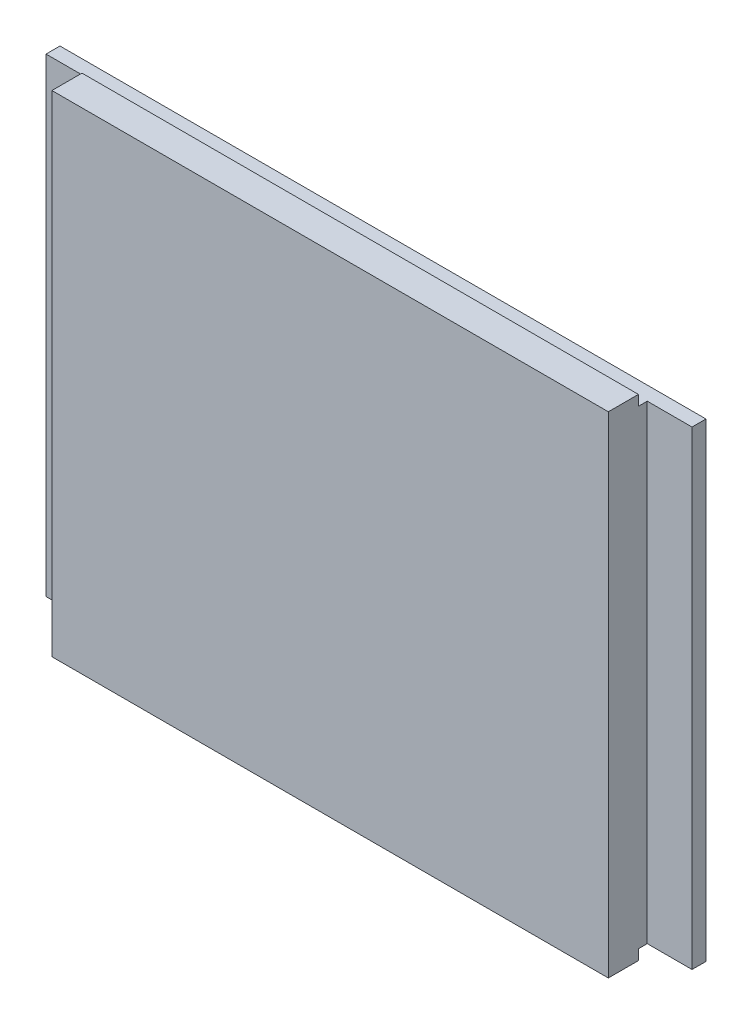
from build123d import *

# Parameters (mm, degrees)
ESQUISSE1_W             = 220
ESQUISSE1_H             = 160
BOSS_EXTRU_1_DEPTH      = 18
ESQUISSE4_W             = 15.25
ESQUISSE4_H             = 160
ENL_V_MAT_EXTRU_1_DEPTH = 13.25
BOSS_EXTRU_3_DEPTH      = 3.5
BOSS_EXTRU_3_DEPTH_BACK = 163.5
ESQUISSE5_W             = 189.5
ESQUISSE5_H             = 10.25


with BuildPart() as part:
    # Esquisse1 → Boss.-Extru.1 (new body)
    with BuildSketch(Plane.XY):
        Rectangle(ESQUISSE1_W, ESQUISSE1_H)
    extrude(amount=BOSS_EXTRU_1_DEPTH)

    # Esquisse4 → Enl_v. mat.-Extru.1 (cut)
    with BuildSketch(Plane.XY.offset(18)):
        with Locations((-102.375, 0)):
            Rectangle(ESQUISSE4_W, ESQUISSE4_H)
        with Locations((102.375, 0)):
            Rectangle(ESQUISSE4_W, ESQUISSE4_H)
    extrude(amount=-ENL_V_MAT_EXTRU_1_DEPTH, mode=Mode.SUBTRACT)

    # Esquisse5 → Boss.-Extru.3 (add, two sides: drawn at the far end of the back side and taken through both)
    with BuildSketch(Plane(origin=(0, 80, 0), x_dir=(1, 0, 0), z_dir=(0, 1, 0)).offset(-BOSS_EXTRU_3_DEPTH_BACK)):
        with Locations((0, -12.875)):
            Rectangle(ESQUISSE5_W, ESQUISSE5_H)
    extrude(amount=BOSS_EXTRU_3_DEPTH + BOSS_EXTRU_3_DEPTH_BACK)


solid = part.part
